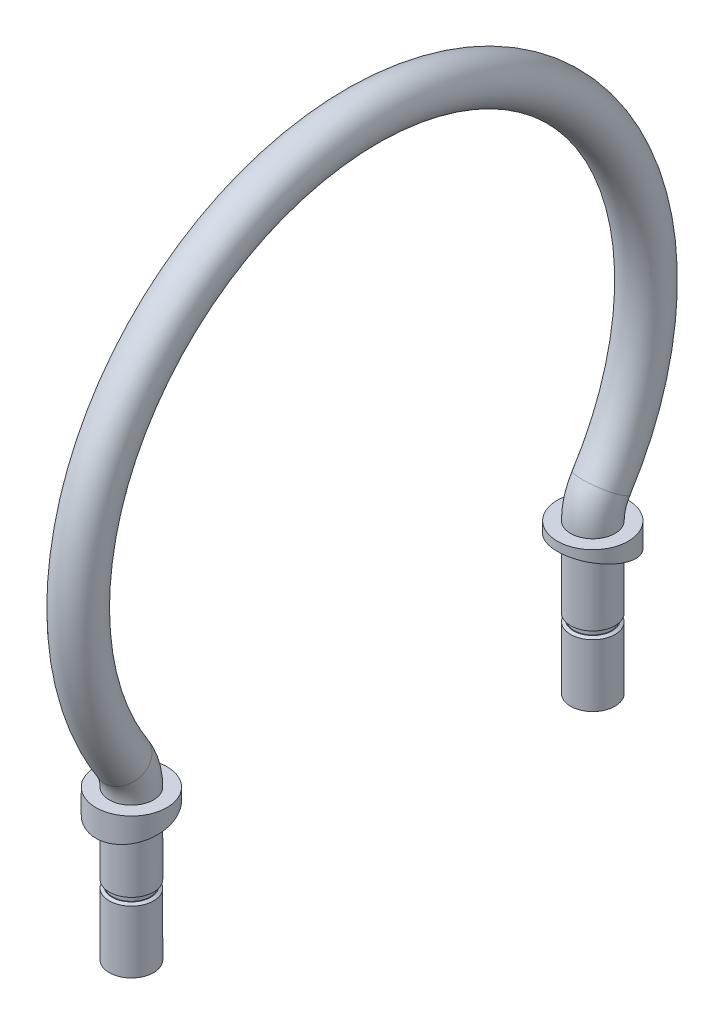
ISO-10303-21;
HEADER;
FILE_DESCRIPTION(('STEP AP214'),'2;1');
FILE_NAME('part.step','',(''),(''),'','','');
FILE_SCHEMA(('AUTOMOTIVE_DESIGN { 1 0 10303 214 1 1 1 1 }'));
ENDSEC;
DATA;
#1=APPLICATION_CONTEXT('core data for automotive mechanical design processes');
#2=APPLICATION_PROTOCOL_DEFINITION('international standard','automotive_design',2000,#1);
#3=PRODUCT_CONTEXT('',#1,'mechanical');
#4=PRODUCT('Part','Part','',(#3));
#5=PRODUCT_RELATED_PRODUCT_CATEGORY('part','',(#4));
#6=PRODUCT_DEFINITION_FORMATION('','',#4);
#7=PRODUCT_DEFINITION_CONTEXT('part definition',#1,'design');
#8=PRODUCT_DEFINITION('design','',#6,#7);
#9=PRODUCT_DEFINITION_SHAPE('','',#8);
#10=(LENGTH_UNIT() NAMED_UNIT(*) SI_UNIT(.MILLI.,.METRE.));
#11=(NAMED_UNIT(*) PLANE_ANGLE_UNIT() SI_UNIT($,.RADIAN.));
#12=(NAMED_UNIT(*) SI_UNIT($,.STERADIAN.) SOLID_ANGLE_UNIT());
#13=UNCERTAINTY_MEASURE_WITH_UNIT(LENGTH_MEASURE(1.E-05),#10,'distance_accuracy_value','');
#14=(GEOMETRIC_REPRESENTATION_CONTEXT(3) GLOBAL_UNCERTAINTY_ASSIGNED_CONTEXT((#13)) GLOBAL_UNIT_ASSIGNED_CONTEXT((#10,
#11,#12)) REPRESENTATION_CONTEXT('',''));
#15=CARTESIAN_POINT('',(0.,0.,0.));
#16=DIRECTION('',(0.,0.,1.));
#17=DIRECTION('',(1.,0.,0.));
#18=AXIS2_PLACEMENT_3D('',#15,#16,#17);
#19=CARTESIAN_POINT('',(0.,-14.2875,41.275));
#20=DIRECTION('',(0.,1.,0.));
#21=DIRECTION('',(0.,0.,1.));
#22=AXIS2_PLACEMENT_3D('',#19,#20,#21);
#23=PLANE('',#22);
#24=CARTESIAN_POINT('',(0.,-14.2875,41.275));
#25=DIRECTION('',(0.,1.,0.));
#26=DIRECTION('',(0.,0.,1.));
#27=AXIS2_PLACEMENT_3D('',#24,#25,#26);
#28=CIRCLE('',#27,3.96875);
#29=CARTESIAN_POINT('',(0.,-14.2875,45.24375));
#30=VERTEX_POINT('',#29);
#31=EDGE_CURVE('E76',#30,#30,#28,.T.);
#32=ORIENTED_EDGE('',*,*,#31,.F.);
#33=EDGE_LOOP('',(#32));
#34=FACE_BOUND('',#33,.T.);
#35=CARTESIAN_POINT('',(0.,-14.2875,41.275));
#36=DIRECTION('',(0.,1.,0.));
#37=DIRECTION('',(0.,0.,1.));
#38=AXIS2_PLACEMENT_3D('',#35,#36,#37);
#39=CIRCLE('',#38,3.33883);
#40=CARTESIAN_POINT('',(0.,-14.2875,44.61383));
#41=VERTEX_POINT('',#40);
#42=EDGE_CURVE('E66',#41,#41,#39,.F.);
#43=ORIENTED_EDGE('',*,*,#42,.F.);
#44=EDGE_LOOP('',(#43));
#45=FACE_BOUND('',#44,.T.);
#46=ADVANCED_FACE('F34',(#34,#45),#23,.F.);
#47=CARTESIAN_POINT('',(0.,-14.2875,-41.275));
#48=DIRECTION('',(0.,1.,0.));
#49=DIRECTION('',(0.,0.,1.));
#50=AXIS2_PLACEMENT_3D('',#47,#48,#49);
#51=PLANE('',#50);
#52=CARTESIAN_POINT('',(0.,-14.2875,-41.275));
#53=DIRECTION('',(0.,1.,0.));
#54=DIRECTION('',(0.,0.,1.));
#55=AXIS2_PLACEMENT_3D('',#52,#53,#54);
#56=CIRCLE('',#55,3.96875);
#57=CARTESIAN_POINT('',(0.,-14.2875,-37.30625));
#58=VERTEX_POINT('',#57);
#59=EDGE_CURVE('E77',#58,#58,#56,.T.);
#60=ORIENTED_EDGE('',*,*,#59,.F.);
#61=EDGE_LOOP('',(#60));
#62=FACE_BOUND('',#61,.T.);
#63=CARTESIAN_POINT('',(0.,-14.2875,-41.275));
#64=DIRECTION('',(0.,1.,0.));
#65=DIRECTION('',(0.,0.,1.));
#66=AXIS2_PLACEMENT_3D('',#63,#64,#65);
#67=CIRCLE('',#66,3.33883);
#68=CARTESIAN_POINT('',(0.,-14.2875,-37.93617));
#69=VERTEX_POINT('',#68);
#70=EDGE_CURVE('E69',#69,#69,#67,.F.);
#71=ORIENTED_EDGE('',*,*,#70,.F.);
#72=EDGE_LOOP('',(#71));
#73=FACE_BOUND('',#72,.T.);
#74=ADVANCED_FACE('F126',(#62,#73),#51,.F.);
#75=CARTESIAN_POINT('',(0.,0.,50.8));
#76=DIRECTION('',(-1.,0.,0.));
#77=DIRECTION('',(0.,0.,1.));
#78=AXIS2_PLACEMENT_3D('',#75,#76,#77);
#79=TOROIDAL_SURFACE('',#78,9.52500000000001,3.96875);
#80=CARTESIAN_POINT('',(0.,5.13695821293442,42.7789473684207));
#81=DIRECTION('',(0.,-0.842105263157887,-0.539313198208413));
#82=DIRECTION('',(0.,0.539313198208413,-0.842105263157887));
#83=AXIS2_PLACEMENT_3D('',#80,#81,#82);
#84=CIRCLE('',#83,3.96875);
#85=CARTESIAN_POINT('',(0.,7.27735746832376,39.4368421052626));
#86=VERTEX_POINT('',#85);
#87=EDGE_CURVE('E84',#86,#86,#84,.T.);
#88=CARTESIAN_POINT('',(0.,-6.66133814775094E-13,41.275));
#89=DIRECTION('',(0.,-1.,0.));
#90=DIRECTION('',(0.,0.,-1.));
#91=AXIS2_PLACEMENT_3D('',#88,#89,#90);
#92=CIRCLE('',#91,3.96875);
#93=CARTESIAN_POINT('',(0.,-9.43689570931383E-13,37.30625));
#94=VERTEX_POINT('',#93);
#95=EDGE_CURVE('E72',#94,#94,#92,.T.);
#96=CARTESIAN_POINT('',(0.,0.,50.8));
#97=DIRECTION('',(-1.,0.,0.));
#98=DIRECTION('',(0.,0.,1.));
#99=AXIS2_PLACEMENT_3D('',#96,#97,#98);
#100=CIRCLE('',#99,13.49375);
#101=EDGE_CURVE('',#86,#94,#100,.T.);
#102=ORIENTED_EDGE('',*,*,#87,.T.);
#103=ORIENTED_EDGE('',*,*,#95,.F.);
#104=ORIENTED_EDGE('',*,*,#101,.T.);
#105=ORIENTED_EDGE('',*,*,#101,.F.);
#106=EDGE_LOOP('',(#102,#104,#103,#105));
#107=FACE_BOUND('',#106,.T.);
#108=ADVANCED_FACE('F132',(#107),#79,.T.);
#109=CARTESIAN_POINT('',(0.,32.5340686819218,0.));
#110=DIRECTION('',(1.,0.,0.));
#111=DIRECTION('',(0.,0.,-1.));
#112=AXIS2_PLACEMENT_3D('',#109,#110,#111);
#113=TOROIDAL_SURFACE('',#112,50.8,3.96875);
#114=CARTESIAN_POINT('',(0.,5.13695821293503,-42.778947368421));
#115=DIRECTION('',(0.,0.842105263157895,-0.5393131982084));
#116=DIRECTION('',(0.,0.5393131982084,0.842105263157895));
#117=AXIS2_PLACEMENT_3D('',#114,#115,#116);
#118=CIRCLE('',#117,3.96875);
#119=CARTESIAN_POINT('',(0.,7.27735746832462,-39.4368421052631));
#120=VERTEX_POINT('',#119);
#121=EDGE_CURVE('E87',#120,#120,#118,.T.);
#122=ORIENTED_EDGE('',*,*,#121,.T.);
#123=EDGE_LOOP('',(#122));
#124=FACE_BOUND('',#123,.T.);
#125=ORIENTED_EDGE('',*,*,#87,.F.);
#126=EDGE_LOOP('',(#125));
#127=FACE_BOUND('',#126,.T.);
#128=ADVANCED_FACE('F170',(#124,#127),#113,.T.);
#129=CARTESIAN_POINT('',(0.,0.,-50.8));
#130=DIRECTION('',(1.,0.,0.));
#131=DIRECTION('',(0.,0.,-1.));
#132=AXIS2_PLACEMENT_3D('',#129,#130,#131);
#133=TOROIDAL_SURFACE('',#132,9.52500000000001,3.96875);
#134=CARTESIAN_POINT('',(0.,0.,-41.275));
#135=DIRECTION('',(0.,1.,0.));
#136=DIRECTION('',(0.,0.,1.));
#137=AXIS2_PLACEMENT_3D('',#134,#135,#136);
#138=CIRCLE('',#137,3.96875);
#139=CARTESIAN_POINT('',(0.,0.,-37.30625));
#140=VERTEX_POINT('',#139);
#141=EDGE_CURVE('E90',#140,#140,#138,.T.);
#142=CARTESIAN_POINT('',(0.,0.,-50.8));
#143=DIRECTION('',(1.,0.,0.));
#144=DIRECTION('',(0.,0.,-1.));
#145=AXIS2_PLACEMENT_3D('',#142,#143,#144);
#146=CIRCLE('',#145,13.49375);
#147=EDGE_CURVE('',#120,#140,#146,.T.);
#148=ORIENTED_EDGE('',*,*,#121,.F.);
#149=ORIENTED_EDGE('',*,*,#141,.T.);
#150=ORIENTED_EDGE('',*,*,#147,.T.);
#151=ORIENTED_EDGE('',*,*,#147,.F.);
#152=EDGE_LOOP('',(#148,#150,#149,#151));
#153=FACE_BOUND('',#152,.T.);
#154=ADVANCED_FACE('F163',(#153),#133,.T.);
#155=CARTESIAN_POINT('',(0.,0.,-41.275));
#156=DIRECTION('',(0.,1.,0.));
#157=DIRECTION('',(0.,0.,1.));
#158=AXIS2_PLACEMENT_3D('',#155,#156,#157);
#159=PLANE('',#158);
#160=CARTESIAN_POINT('',(0.,0.,-41.275));
#161=DIRECTION('',(0.,1.,0.));
#162=DIRECTION('',(0.,0.,1.));
#163=AXIS2_PLACEMENT_3D('',#160,#161,#162);
#164=CIRCLE('',#163,6.35);
#165=CARTESIAN_POINT('',(0.,0.,-34.925));
#166=VERTEX_POINT('',#165);
#167=EDGE_CURVE('E93',#166,#166,#164,.T.);
#168=ORIENTED_EDGE('',*,*,#167,.T.);
#169=EDGE_LOOP('',(#168));
#170=FACE_BOUND('',#169,.T.);
#171=ORIENTED_EDGE('',*,*,#141,.F.);
#172=EDGE_LOOP('',(#171));
#173=FACE_BOUND('',#172,.T.);
#174=ADVANCED_FACE('F160',(#170,#173),#159,.T.);
#175=CARTESIAN_POINT('',(0.,-4.7625,-41.275));
#176=DIRECTION('',(0.,1.,0.));
#177=DIRECTION('',(0.,0.,1.));
#178=AXIS2_PLACEMENT_3D('',#175,#176,#177);
#179=CYLINDRICAL_SURFACE('',#178,6.35);
#180=CARTESIAN_POINT('',(0.,-3.17499999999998,-41.275));
#181=DIRECTION('',(0.,0.970142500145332,-0.242535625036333));
#182=DIRECTION('',(0.,0.242535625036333,0.970142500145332));
#183=AXIS2_PLACEMENT_3D('',#180,#181,#182);
#184=ELLIPSE('',#183,6.54543018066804,6.35);
#185=CARTESIAN_POINT('',(0.,-1.58749999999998,-34.925));
#186=VERTEX_POINT('',#185);
#187=EDGE_CURVE('E81',#186,#186,#184,.F.);
#188=ORIENTED_EDGE('',*,*,#187,.F.);
#189=EDGE_LOOP('',(#188));
#190=FACE_BOUND('',#189,.T.);
#191=ORIENTED_EDGE('',*,*,#167,.F.);
#192=EDGE_LOOP('',(#191));
#193=FACE_BOUND('',#192,.T.);
#194=ADVANCED_FACE('F158',(#190,#193),#179,.T.);
#195=CARTESIAN_POINT('',(0.,-4.7625,41.275));
#196=DIRECTION('',(0.,1.,0.));
#197=DIRECTION('',(0.,0.,1.));
#198=AXIS2_PLACEMENT_3D('',#195,#196,#197);
#199=CYLINDRICAL_SURFACE('',#198,6.35);
#200=CARTESIAN_POINT('',(0.,-3.17499999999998,41.275));
#201=DIRECTION('',(0.,0.970142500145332,0.242535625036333));
#202=DIRECTION('',(0.,0.242535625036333,-0.970142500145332));
#203=AXIS2_PLACEMENT_3D('',#200,#201,#202);
#204=ELLIPSE('',#203,6.54543018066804,6.35);
#205=CARTESIAN_POINT('',(0.,-1.58749999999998,34.925));
#206=VERTEX_POINT('',#205);
#207=EDGE_CURVE('E99',#206,#206,#204,.F.);
#208=ORIENTED_EDGE('',*,*,#207,.F.);
#209=EDGE_LOOP('',(#208));
#210=FACE_BOUND('',#209,.T.);
#211=CARTESIAN_POINT('',(0.,0.,41.275));
#212=DIRECTION('',(0.,1.,0.));
#213=DIRECTION('',(0.,0.,1.));
#214=AXIS2_PLACEMENT_3D('',#211,#212,#213);
#215=CIRCLE('',#214,6.35);
#216=CARTESIAN_POINT('',(0.,0.,47.625));
#217=VERTEX_POINT('',#216);
#218=EDGE_CURVE('E96',#217,#217,#215,.T.);
#219=ORIENTED_EDGE('',*,*,#218,.F.);
#220=EDGE_LOOP('',(#219));
#221=FACE_BOUND('',#220,.T.);
#222=ADVANCED_FACE('F154',(#210,#221),#199,.T.);
#223=CARTESIAN_POINT('',(0.,0.,41.275));
#224=DIRECTION('',(0.,1.,0.));
#225=DIRECTION('',(0.,0.,1.));
#226=AXIS2_PLACEMENT_3D('',#223,#224,#225);
#227=PLANE('',#226);
#228=ORIENTED_EDGE('',*,*,#95,.T.);
#229=EDGE_LOOP('',(#228));
#230=FACE_BOUND('',#229,.T.);
#231=ORIENTED_EDGE('',*,*,#218,.T.);
#232=EDGE_LOOP('',(#231));
#233=FACE_BOUND('',#232,.T.);
#234=ADVANCED_FACE('F150',(#230,#233),#227,.T.);
#235=CARTESIAN_POINT('',(-6.35,-1.58750000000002,34.925));
#236=DIRECTION('',(0.,0.970142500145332,0.242535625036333));
#237=DIRECTION('',(0.,-0.242535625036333,0.970142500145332));
#238=AXIS2_PLACEMENT_3D('',#235,#236,#237);
#239=PLANE('',#238);
#240=CARTESIAN_POINT('',(0.,-3.17499999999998,41.275));
#241=DIRECTION('',(0.,0.970142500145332,0.242535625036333));
#242=DIRECTION('',(0.,0.242535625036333,-0.970142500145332));
#243=AXIS2_PLACEMENT_3D('',#240,#241,#242);
#244=ELLIPSE('',#243,4.09089386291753,3.96875);
#245=CARTESIAN_POINT('',(0.,-2.18281249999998,37.30625));
#246=VERTEX_POINT('',#245);
#247=EDGE_CURVE('E78',#246,#246,#244,.T.);
#248=ORIENTED_EDGE('',*,*,#247,.T.);
#249=EDGE_LOOP('',(#248));
#250=FACE_BOUND('',#249,.T.);
#251=ORIENTED_EDGE('',*,*,#207,.T.);
#252=EDGE_LOOP('',(#251));
#253=FACE_BOUND('',#252,.T.);
#254=ADVANCED_FACE('F146',(#250,#253),#239,.F.);
#255=CARTESIAN_POINT('',(-6.35,-1.58750000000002,-34.925));
#256=DIRECTION('',(0.,0.970142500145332,-0.242535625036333));
#257=DIRECTION('',(0.,0.242535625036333,0.970142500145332));
#258=AXIS2_PLACEMENT_3D('',#255,#256,#257);
#259=PLANE('',#258);
#260=CARTESIAN_POINT('',(0.,-3.17499999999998,-41.275));
#261=DIRECTION('',(0.,0.970142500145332,-0.242535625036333));
#262=DIRECTION('',(0.,0.242535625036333,0.970142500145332));
#263=AXIS2_PLACEMENT_3D('',#260,#261,#262);
#264=ELLIPSE('',#263,4.09089386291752,3.96875);
#265=CARTESIAN_POINT('',(0.,-2.18281249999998,-37.30625));
#266=VERTEX_POINT('',#265);
#267=EDGE_CURVE('E73',#266,#266,#264,.T.);
#268=ORIENTED_EDGE('',*,*,#267,.T.);
#269=EDGE_LOOP('',(#268));
#270=FACE_BOUND('',#269,.T.);
#271=ORIENTED_EDGE('',*,*,#187,.T.);
#272=EDGE_LOOP('',(#271));
#273=FACE_BOUND('',#272,.T.);
#274=ADVANCED_FACE('F142',(#270,#273),#259,.F.);
#275=CARTESIAN_POINT('',(0.,-14.2875,41.275));
#276=DIRECTION('',(0.,1.,0.));
#277=DIRECTION('',(0.,0.,1.));
#278=AXIS2_PLACEMENT_3D('',#275,#276,#277);
#279=CYLINDRICAL_SURFACE('',#278,3.96875);
#280=ORIENTED_EDGE('',*,*,#31,.T.);
#281=EDGE_LOOP('',(#280));
#282=FACE_BOUND('',#281,.T.);
#283=ORIENTED_EDGE('',*,*,#247,.F.);
#284=EDGE_LOOP('',(#283));
#285=FACE_BOUND('',#284,.T.);
#286=ADVANCED_FACE('F139',(#282,#285),#279,.T.);
#287=CARTESIAN_POINT('',(0.,-14.2875,-41.275));
#288=DIRECTION('',(0.,1.,0.));
#289=DIRECTION('',(0.,0.,1.));
#290=AXIS2_PLACEMENT_3D('',#287,#288,#289);
#291=CYLINDRICAL_SURFACE('',#290,3.96875);
#292=ORIENTED_EDGE('',*,*,#59,.T.);
#293=EDGE_LOOP('',(#292));
#294=FACE_BOUND('',#293,.T.);
#295=ORIENTED_EDGE('',*,*,#267,.F.);
#296=EDGE_LOOP('',(#295));
#297=FACE_BOUND('',#296,.T.);
#298=ADVANCED_FACE('F138',(#294,#297),#291,.T.);
#299=CARTESIAN_POINT('',(0.,-15.3458333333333,-41.275));
#300=DIRECTION('',(0.,1.,0.));
#301=DIRECTION('',(0.,0.,1.));
#302=AXIS2_PLACEMENT_3D('',#299,#300,#301);
#303=CYLINDRICAL_SURFACE('',#302,3.33883);
#304=CARTESIAN_POINT('',(0.,-15.3458333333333,-41.275));
#305=DIRECTION('',(0.,-1.,0.));
#306=DIRECTION('',(0.,0.,-1.));
#307=AXIS2_PLACEMENT_3D('',#304,#305,#306);
#308=CIRCLE('',#307,3.33883);
#309=CARTESIAN_POINT('',(0.,-15.3458333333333,-44.61383));
#310=VERTEX_POINT('',#309);
#311=EDGE_CURVE('E108',#310,#310,#308,.T.);
#312=ORIENTED_EDGE('',*,*,#311,.F.);
#313=EDGE_LOOP('',(#312));
#314=FACE_BOUND('',#313,.T.);
#315=ORIENTED_EDGE('',*,*,#70,.T.);
#316=EDGE_LOOP('',(#315));
#317=FACE_BOUND('',#316,.T.);
#318=ADVANCED_FACE('F121',(#314,#317),#303,.T.);
#319=CARTESIAN_POINT('',(0.,-15.3458333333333,41.275));
#320=DIRECTION('',(0.,1.,0.));
#321=DIRECTION('',(0.,0.,1.));
#322=AXIS2_PLACEMENT_3D('',#319,#320,#321);
#323=CYLINDRICAL_SURFACE('',#322,3.33883);
#324=CARTESIAN_POINT('',(0.,-15.3458333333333,41.275));
#325=DIRECTION('',(0.,-1.,0.));
#326=DIRECTION('',(0.,0.,-1.));
#327=AXIS2_PLACEMENT_3D('',#324,#325,#326);
#328=CIRCLE('',#327,3.33883);
#329=CARTESIAN_POINT('',(0.,-15.3458333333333,37.93617));
#330=VERTEX_POINT('',#329);
#331=EDGE_CURVE('E111',#330,#330,#328,.T.);
#332=ORIENTED_EDGE('',*,*,#331,.F.);
#333=EDGE_LOOP('',(#332));
#334=FACE_BOUND('',#333,.T.);
#335=ORIENTED_EDGE('',*,*,#42,.T.);
#336=EDGE_LOOP('',(#335));
#337=FACE_BOUND('',#336,.T.);
#338=ADVANCED_FACE('F117',(#334,#337),#323,.T.);
#339=CARTESIAN_POINT('',(0.,-15.3458333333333,-41.275));
#340=DIRECTION('',(0.,-1.,0.));
#341=DIRECTION('',(0.,0.,-1.));
#342=AXIS2_PLACEMENT_3D('',#339,#340,#341);
#343=PLANE('',#342);
#344=CARTESIAN_POINT('',(0.,-15.3458333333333,-41.275));
#345=DIRECTION('',(0.,-1.,0.));
#346=DIRECTION('',(0.,0.,-1.));
#347=AXIS2_PLACEMENT_3D('',#344,#345,#346);
#348=CIRCLE('',#347,3.46074999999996);
#349=CARTESIAN_POINT('',(0.,-15.3458333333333,-44.7357499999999));
#350=VERTEX_POINT('',#349);
#351=EDGE_CURVE('E10',#350,#350,#348,.F.);
#352=ORIENTED_EDGE('',*,*,#351,.T.);
#353=EDGE_LOOP('',(#352));
#354=FACE_BOUND('',#353,.T.);
#355=ORIENTED_EDGE('',*,*,#311,.T.);
#356=EDGE_LOOP('',(#355));
#357=FACE_BOUND('',#356,.T.);
#358=ADVANCED_FACE('F120',(#354,#357),#343,.F.);
#359=CARTESIAN_POINT('',(0.,-27.2330333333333,-41.275));
#360=DIRECTION('',(0.,1.,0.));
#361=DIRECTION('',(0.,0.,1.));
#362=AXIS2_PLACEMENT_3D('',#359,#360,#361);
#363=CYLINDRICAL_SURFACE('',#362,3.96875);
#364=CARTESIAN_POINT('',(0.,-15.6391272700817,-41.275));
#365=DIRECTION('',(0.,-1.,0.));
#366=DIRECTION('',(0.,0.,-1.));
#367=AXIS2_PLACEMENT_3D('',#364,#365,#366);
#368=CIRCLE('',#367,3.96875);
#369=CARTESIAN_POINT('',(0.,-15.6391272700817,-45.24375));
#370=VERTEX_POINT('',#369);
#371=EDGE_CURVE('E41',#370,#370,#368,.T.);
#372=ORIENTED_EDGE('',*,*,#371,.T.);
#373=EDGE_LOOP('',(#372));
#374=FACE_BOUND('',#373,.T.);
#375=CARTESIAN_POINT('',(0.,-26.7747615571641,-41.275));
#376=DIRECTION('',(0.,-1.,0.));
#377=DIRECTION('',(0.,0.,-1.));
#378=AXIS2_PLACEMENT_3D('',#375,#376,#377);
#379=CIRCLE('',#378,3.96875);
#380=CARTESIAN_POINT('',(0.,-26.7747615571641,-37.30625));
#381=VERTEX_POINT('',#380);
#382=EDGE_CURVE('E54',#381,#381,#379,.F.);
#383=ORIENTED_EDGE('',*,*,#382,.T.);
#384=EDGE_LOOP('',(#383));
#385=FACE_BOUND('',#384,.T.);
#386=ADVANCED_FACE('F216',(#374,#385),#363,.T.);
#387=CARTESIAN_POINT('',(0.,-27.2330333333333,-41.275));
#388=DIRECTION('',(0.,-1.,0.));
#389=DIRECTION('',(0.,0.,-1.));
#390=AXIS2_PLACEMENT_3D('',#387,#388,#389);
#391=PLANE('',#390);
#392=CARTESIAN_POINT('',(0.,-27.2330333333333,-41.275));
#393=DIRECTION('',(0.,-1.,0.));
#394=DIRECTION('',(0.,0.,-1.));
#395=AXIS2_PLACEMENT_3D('',#392,#393,#394);
#396=CIRCLE('',#395,3.17499999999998);
#397=CARTESIAN_POINT('',(0.,-27.2330333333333,-38.1));
#398=VERTEX_POINT('',#397);
#399=EDGE_CURVE('E57',#398,#398,#396,.T.);
#400=ORIENTED_EDGE('',*,*,#399,.T.);
#401=EDGE_LOOP('',(#400));
#402=FACE_BOUND('',#401,.T.);
#403=ADVANCED_FACE('F211',(#402),#391,.T.);
#404=CARTESIAN_POINT('',(0.,-15.3458333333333,41.275));
#405=DIRECTION('',(0.,-1.,0.));
#406=DIRECTION('',(0.,0.,-1.));
#407=AXIS2_PLACEMENT_3D('',#404,#405,#406);
#408=PLANE('',#407);
#409=CARTESIAN_POINT('',(0.,-15.3458333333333,41.275));
#410=DIRECTION('',(0.,-1.,0.));
#411=DIRECTION('',(0.,0.,-1.));
#412=AXIS2_PLACEMENT_3D('',#409,#410,#411);
#413=CIRCLE('',#412,3.46075000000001);
#414=CARTESIAN_POINT('',(0.,-15.3458333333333,37.81425));
#415=VERTEX_POINT('',#414);
#416=EDGE_CURVE('E45',#415,#415,#413,.F.);
#417=ORIENTED_EDGE('',*,*,#416,.T.);
#418=EDGE_LOOP('',(#417));
#419=FACE_BOUND('',#418,.T.);
#420=ORIENTED_EDGE('',*,*,#331,.T.);
#421=EDGE_LOOP('',(#420));
#422=FACE_BOUND('',#421,.T.);
#423=ADVANCED_FACE('F115',(#419,#422),#408,.F.);
#424=CARTESIAN_POINT('',(0.,-27.2330333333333,41.275));
#425=DIRECTION('',(0.,1.,0.));
#426=DIRECTION('',(0.,0.,1.));
#427=AXIS2_PLACEMENT_3D('',#424,#425,#426);
#428=CYLINDRICAL_SURFACE('',#427,3.96875);
#429=CARTESIAN_POINT('',(0.,-15.6391272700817,41.275));
#430=DIRECTION('',(0.,-1.,0.));
#431=DIRECTION('',(0.,0.,-1.));
#432=AXIS2_PLACEMENT_3D('',#429,#430,#431);
#433=CIRCLE('',#432,3.96875);
#434=CARTESIAN_POINT('',(0.,-15.6391272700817,37.30625));
#435=VERTEX_POINT('',#434);
#436=EDGE_CURVE('E49',#435,#435,#433,.T.);
#437=ORIENTED_EDGE('',*,*,#436,.T.);
#438=EDGE_LOOP('',(#437));
#439=FACE_BOUND('',#438,.T.);
#440=CARTESIAN_POINT('',(0.,-26.7747615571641,41.275));
#441=DIRECTION('',(0.,-1.,0.));
#442=DIRECTION('',(0.,0.,-1.));
#443=AXIS2_PLACEMENT_3D('',#440,#441,#442);
#444=CIRCLE('',#443,3.96875);
#445=CARTESIAN_POINT('',(0.,-26.7747615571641,45.24375));
#446=VERTEX_POINT('',#445);
#447=EDGE_CURVE('E60',#446,#446,#444,.F.);
#448=ORIENTED_EDGE('',*,*,#447,.T.);
#449=EDGE_LOOP('',(#448));
#450=FACE_BOUND('',#449,.T.);
#451=ADVANCED_FACE('F197',(#439,#450),#428,.T.);
#452=CARTESIAN_POINT('',(0.,-27.2330333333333,41.275));
#453=DIRECTION('',(0.,-1.,0.));
#454=DIRECTION('',(0.,0.,-1.));
#455=AXIS2_PLACEMENT_3D('',#452,#453,#454);
#456=PLANE('',#455);
#457=CARTESIAN_POINT('',(0.,-27.2330333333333,41.275));
#458=DIRECTION('',(0.,-1.,0.));
#459=DIRECTION('',(0.,0.,-1.));
#460=AXIS2_PLACEMENT_3D('',#457,#458,#459);
#461=CIRCLE('',#460,3.17499999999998);
#462=CARTESIAN_POINT('',(0.,-27.2330333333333,44.45));
#463=VERTEX_POINT('',#462);
#464=EDGE_CURVE('E63',#463,#463,#461,.T.);
#465=ORIENTED_EDGE('',*,*,#464,.T.);
#466=EDGE_LOOP('',(#465));
#467=FACE_BOUND('',#466,.T.);
#468=ADVANCED_FACE('F182',(#467),#456,.T.);
#469=CARTESIAN_POINT('',(0.,-27.2330333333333,41.275));
#470=DIRECTION('',(0.,1.,0.));
#471=DIRECTION('',(0.,0.,1.));
#472=AXIS2_PLACEMENT_3D('',#469,#470,#471);
#473=CONICAL_SURFACE('',#472,3.17499999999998,1.04719755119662);
#474=CARTESIAN_POINT('',(0.,-26.7747615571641,45.24375));
#475=CARTESIAN_POINT('',(0.,-26.7795352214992,45.2354817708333));
#476=CARTESIAN_POINT('',(0.,-26.7843088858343,45.2272135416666));
#477=CARTESIAN_POINT('',(0.,-26.7938562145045,45.2106770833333));
#478=CARTESIAN_POINT('',(0.,-26.7986298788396,45.2024088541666));
#479=CARTESIAN_POINT('',(0.,-26.8081772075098,45.1858723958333));
#480=CARTESIAN_POINT('',(0.,-26.8129508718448,45.1776041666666));
#481=CARTESIAN_POINT('',(0.,-26.822498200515,45.1610677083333));
#482=CARTESIAN_POINT('',(0.,-26.8272718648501,45.1527994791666));
#483=CARTESIAN_POINT('',(0.,-26.8368191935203,45.1362630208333));
#484=CARTESIAN_POINT('',(0.,-26.8415928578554,45.1279947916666));
#485=CARTESIAN_POINT('',(0.,-26.8511401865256,45.1114583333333));
#486=CARTESIAN_POINT('',(0.,-26.8559138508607,45.1031901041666));
#487=CARTESIAN_POINT('',(0.,-26.8654611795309,45.0866536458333));
#488=CARTESIAN_POINT('',(0.,-26.870234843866,45.0783854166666));
#489=CARTESIAN_POINT('',(0.,-26.8797821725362,45.0618489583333));
#490=CARTESIAN_POINT('',(0.,-26.8845558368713,45.0535807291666));
#491=CARTESIAN_POINT('',(0.,-26.8941031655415,45.0370442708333));
#492=CARTESIAN_POINT('',(0.,-26.8988768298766,45.0287760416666));
#493=CARTESIAN_POINT('',(0.,-26.9084241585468,45.0122395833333));
#494=CARTESIAN_POINT('',(0.,-26.9131978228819,45.0039713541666));
#495=CARTESIAN_POINT('',(0.,-26.9227451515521,44.9874348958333));
#496=CARTESIAN_POINT('',(0.,-26.9275188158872,44.9791666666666));
#497=CARTESIAN_POINT('',(0.,-26.9370661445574,44.9626302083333));
#498=CARTESIAN_POINT('',(0.,-26.9418398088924,44.9543619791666));
#499=CARTESIAN_POINT('',(0.,-26.9513871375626,44.9378255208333));
#500=CARTESIAN_POINT('',(0.,-26.9561608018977,44.9295572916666));
#501=CARTESIAN_POINT('',(0.,-26.9657081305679,44.9130208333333));
#502=CARTESIAN_POINT('',(0.,-26.970481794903,44.9047526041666));
#503=CARTESIAN_POINT('',(0.,-26.9800291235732,44.8882161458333));
#504=CARTESIAN_POINT('',(0.,-26.9848027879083,44.8799479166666));
#505=CARTESIAN_POINT('',(0.,-26.9943501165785,44.8634114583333));
#506=CARTESIAN_POINT('',(0.,-26.9991237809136,44.8551432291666));
#507=CARTESIAN_POINT('',(0.,-27.0086711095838,44.8386067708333));
#508=CARTESIAN_POINT('',(0.,-27.0134447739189,44.8303385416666));
#509=CARTESIAN_POINT('',(0.,-27.0229921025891,44.8138020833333));
#510=CARTESIAN_POINT('',(0.,-27.0277657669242,44.8055338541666));
#511=CARTESIAN_POINT('',(0.,-27.0373130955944,44.7889973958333));
#512=CARTESIAN_POINT('',(0.,-27.0420867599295,44.7807291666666));
#513=CARTESIAN_POINT('',(0.,-27.0516340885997,44.7641927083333));
#514=CARTESIAN_POINT('',(0.,-27.0564077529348,44.7559244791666));
#515=CARTESIAN_POINT('',(0.,-27.065955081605,44.7393880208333));
#516=CARTESIAN_POINT('',(0.,-27.07072874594,44.7311197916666));
#517=CARTESIAN_POINT('',(0.,-27.0802760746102,44.7145833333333));
#518=CARTESIAN_POINT('',(0.,-27.0850497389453,44.7063151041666));
#519=CARTESIAN_POINT('',(0.,-27.0945970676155,44.6897786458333));
#520=CARTESIAN_POINT('',(0.,-27.0993707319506,44.6815104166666));
#521=CARTESIAN_POINT('',(0.,-27.1089180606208,44.6649739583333));
#522=CARTESIAN_POINT('',(0.,-27.1136917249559,44.6567057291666));
#523=CARTESIAN_POINT('',(0.,-27.1232390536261,44.6401692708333));
#524=CARTESIAN_POINT('',(0.,-27.1280127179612,44.6319010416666));
#525=CARTESIAN_POINT('',(0.,-27.1375600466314,44.6153645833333));
#526=CARTESIAN_POINT('',(0.,-27.1423337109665,44.6070963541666));
#527=CARTESIAN_POINT('',(0.,-27.1518810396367,44.5905598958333));
#528=CARTESIAN_POINT('',(0.,-27.1566547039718,44.5822916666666));
#529=CARTESIAN_POINT('',(0.,-27.166202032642,44.5657552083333));
#530=CARTESIAN_POINT('',(0.,-27.1709756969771,44.5574869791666));
#531=CARTESIAN_POINT('',(0.,-27.1805230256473,44.5409505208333));
#532=CARTESIAN_POINT('',(0.,-27.1852966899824,44.5326822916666));
#533=CARTESIAN_POINT('',(0.,-27.1948440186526,44.5161458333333));
#534=CARTESIAN_POINT('',(0.,-27.1996176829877,44.5078776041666));
#535=CARTESIAN_POINT('',(0.,-27.2091650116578,44.4913411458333));
#536=CARTESIAN_POINT('',(0.,-27.2139386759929,44.4830729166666));
#537=CARTESIAN_POINT('',(0.,-27.2234860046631,44.4665364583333));
#538=CARTESIAN_POINT('',(0.,-27.2282596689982,44.4582682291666));
#539=CARTESIAN_POINT('',(0.,-27.2330333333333,44.45));
#540=B_SPLINE_CURVE_WITH_KNOTS('',3,(#474,#475,#476,#477,#478,#479,#480,#481,#482,#483,#484,
#485,#486,#487,#488,#489,#490,#491,#492,#493,#494,#495,#496,#497,#498,#499,#500,#501,#502,#503,
#504,#505,#506,#507,#508,#509,#510,#511,#512,#513,#514,#515,#516,#517,#518,#519,#520,#521,#522,
#523,#524,#525,#526,#527,#528,#529,#530,#531,#532,#533,#534,#535,#536,#537,#538,#539),
.UNSPECIFIED.,.F.,.F.,(4,2,2,2,2,2,2,2,2,2,2,2,2,2,2,2,2,2,2,2,2,2,2,2,2,2,2,2,2,2,2,2,4),(0.,
0.028641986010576,0.0572839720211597,0.0859259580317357,0.114567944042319,0.143209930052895,
0.171851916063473,0.200493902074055,0.229135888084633,0.257777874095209,0.286419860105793,
0.315061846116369,0.343703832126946,0.372345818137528,0.400987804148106,0.429629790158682,
0.458271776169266,0.486913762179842,0.51555574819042,0.544197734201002,0.572839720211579,
0.601481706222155,0.630123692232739,0.658765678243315,0.687407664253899,0.716049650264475,
0.744691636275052,0.773333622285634,0.801975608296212,0.830617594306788,0.859259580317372,
0.887901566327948,0.916543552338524),.UNSPECIFIED.);
#541=EDGE_CURVE('BSEAM178',#446,#463,#540,.T.);
#542=ORIENTED_EDGE('',*,*,#447,.F.);
#543=ORIENTED_EDGE('',*,*,#464,.F.);
#544=ORIENTED_EDGE('',*,*,#541,.T.);
#545=ORIENTED_EDGE('',*,*,#541,.F.);
#546=EDGE_LOOP('',(#542,#544,#543,#545));
#547=FACE_BOUND('',#546,.T.);
#548=ADVANCED_FACE('F178',(#547),#473,.T.);
#549=CARTESIAN_POINT('',(0.,-27.2330333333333,-41.275));
#550=DIRECTION('',(0.,1.,0.));
#551=DIRECTION('',(0.,0.,1.));
#552=AXIS2_PLACEMENT_3D('',#549,#550,#551);
#553=CONICAL_SURFACE('',#552,3.17499999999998,1.04719755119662);
#554=CARTESIAN_POINT('',(0.,-26.7747615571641,-37.30625));
#555=CARTESIAN_POINT('',(0.,-26.7795352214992,-37.3145182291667));
#556=CARTESIAN_POINT('',(0.,-26.7843088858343,-37.3227864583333));
#557=CARTESIAN_POINT('',(0.,-26.7938562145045,-37.3393229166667));
#558=CARTESIAN_POINT('',(0.,-26.7986298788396,-37.3475911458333));
#559=CARTESIAN_POINT('',(0.,-26.8081772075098,-37.3641276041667));
#560=CARTESIAN_POINT('',(0.,-26.8129508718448,-37.3723958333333));
#561=CARTESIAN_POINT('',(0.,-26.822498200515,-37.3889322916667));
#562=CARTESIAN_POINT('',(0.,-26.8272718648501,-37.3972005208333));
#563=CARTESIAN_POINT('',(0.,-26.8368191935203,-37.4137369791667));
#564=CARTESIAN_POINT('',(0.,-26.8415928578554,-37.4220052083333));
#565=CARTESIAN_POINT('',(0.,-26.8511401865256,-37.4385416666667));
#566=CARTESIAN_POINT('',(0.,-26.8559138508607,-37.4468098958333));
#567=CARTESIAN_POINT('',(0.,-26.8654611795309,-37.4633463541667));
#568=CARTESIAN_POINT('',(0.,-26.870234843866,-37.4716145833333));
#569=CARTESIAN_POINT('',(0.,-26.8797821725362,-37.4881510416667));
#570=CARTESIAN_POINT('',(0.,-26.8845558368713,-37.4964192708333));
#571=CARTESIAN_POINT('',(0.,-26.8941031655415,-37.5129557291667));
#572=CARTESIAN_POINT('',(0.,-26.8988768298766,-37.5212239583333));
#573=CARTESIAN_POINT('',(0.,-26.9084241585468,-37.5377604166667));
#574=CARTESIAN_POINT('',(0.,-26.9131978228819,-37.5460286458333));
#575=CARTESIAN_POINT('',(0.,-26.9227451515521,-37.5625651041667));
#576=CARTESIAN_POINT('',(0.,-26.9275188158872,-37.5708333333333));
#577=CARTESIAN_POINT('',(0.,-26.9370661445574,-37.5873697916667));
#578=CARTESIAN_POINT('',(0.,-26.9418398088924,-37.5956380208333));
#579=CARTESIAN_POINT('',(0.,-26.9513871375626,-37.6121744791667));
#580=CARTESIAN_POINT('',(0.,-26.9561608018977,-37.6204427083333));
#581=CARTESIAN_POINT('',(0.,-26.9657081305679,-37.6369791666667));
#582=CARTESIAN_POINT('',(0.,-26.970481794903,-37.6452473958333));
#583=CARTESIAN_POINT('',(0.,-26.9800291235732,-37.6617838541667));
#584=CARTESIAN_POINT('',(0.,-26.9848027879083,-37.6700520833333));
#585=CARTESIAN_POINT('',(0.,-26.9943501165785,-37.6865885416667));
#586=CARTESIAN_POINT('',(0.,-26.9991237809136,-37.6948567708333));
#587=CARTESIAN_POINT('',(0.,-27.0086711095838,-37.7113932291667));
#588=CARTESIAN_POINT('',(0.,-27.0134447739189,-37.7196614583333));
#589=CARTESIAN_POINT('',(0.,-27.0229921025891,-37.7361979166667));
#590=CARTESIAN_POINT('',(0.,-27.0277657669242,-37.7444661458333));
#591=CARTESIAN_POINT('',(0.,-27.0373130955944,-37.7610026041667));
#592=CARTESIAN_POINT('',(0.,-27.0420867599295,-37.7692708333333));
#593=CARTESIAN_POINT('',(0.,-27.0516340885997,-37.7858072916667));
#594=CARTESIAN_POINT('',(0.,-27.0564077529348,-37.7940755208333));
#595=CARTESIAN_POINT('',(0.,-27.065955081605,-37.8106119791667));
#596=CARTESIAN_POINT('',(0.,-27.07072874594,-37.8188802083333));
#597=CARTESIAN_POINT('',(0.,-27.0802760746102,-37.8354166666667));
#598=CARTESIAN_POINT('',(0.,-27.0850497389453,-37.8436848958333));
#599=CARTESIAN_POINT('',(0.,-27.0945970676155,-37.8602213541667));
#600=CARTESIAN_POINT('',(0.,-27.0993707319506,-37.8684895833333));
#601=CARTESIAN_POINT('',(0.,-27.1089180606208,-37.8850260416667));
#602=CARTESIAN_POINT('',(0.,-27.1136917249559,-37.8932942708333));
#603=CARTESIAN_POINT('',(0.,-27.1232390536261,-37.9098307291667));
#604=CARTESIAN_POINT('',(0.,-27.1280127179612,-37.9180989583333));
#605=CARTESIAN_POINT('',(0.,-27.1375600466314,-37.9346354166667));
#606=CARTESIAN_POINT('',(0.,-27.1423337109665,-37.9429036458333));
#607=CARTESIAN_POINT('',(0.,-27.1518810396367,-37.9594401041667));
#608=CARTESIAN_POINT('',(0.,-27.1566547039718,-37.9677083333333));
#609=CARTESIAN_POINT('',(0.,-27.166202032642,-37.9842447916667));
#610=CARTESIAN_POINT('',(0.,-27.1709756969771,-37.9925130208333));
#611=CARTESIAN_POINT('',(0.,-27.1805230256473,-38.0090494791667));
#612=CARTESIAN_POINT('',(0.,-27.1852966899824,-38.0173177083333));
#613=CARTESIAN_POINT('',(0.,-27.1948440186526,-38.0338541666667));
#614=CARTESIAN_POINT('',(0.,-27.1996176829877,-38.0421223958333));
#615=CARTESIAN_POINT('',(0.,-27.2091650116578,-38.0586588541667));
#616=CARTESIAN_POINT('',(0.,-27.2139386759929,-38.0669270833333));
#617=CARTESIAN_POINT('',(0.,-27.2234860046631,-38.0834635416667));
#618=CARTESIAN_POINT('',(0.,-27.2282596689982,-38.0917317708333));
#619=CARTESIAN_POINT('',(0.,-27.2330333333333,-38.1));
#620=B_SPLINE_CURVE_WITH_KNOTS('',3,(#554,#555,#556,#557,#558,#559,#560,#561,#562,#563,#564,
#565,#566,#567,#568,#569,#570,#571,#572,#573,#574,#575,#576,#577,#578,#579,#580,#581,#582,#583,
#584,#585,#586,#587,#588,#589,#590,#591,#592,#593,#594,#595,#596,#597,#598,#599,#600,#601,#602,
#603,#604,#605,#606,#607,#608,#609,#610,#611,#612,#613,#614,#615,#616,#617,#618,#619),
.UNSPECIFIED.,.F.,.F.,(4,2,2,2,2,2,2,2,2,2,2,2,2,2,2,2,2,2,2,2,2,2,2,2,2,2,2,2,2,2,2,2,4),(0.,
0.028641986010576,0.0572839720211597,0.0859259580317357,0.114567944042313,0.143209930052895,
0.171851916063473,0.200493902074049,0.229135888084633,0.257777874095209,0.286419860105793,
0.315061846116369,0.343703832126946,0.372345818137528,0.400987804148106,0.429629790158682,
0.458271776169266,0.486913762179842,0.51555574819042,0.544197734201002,0.572839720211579,
0.601481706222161,0.630123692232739,0.658765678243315,0.687407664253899,0.716049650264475,
0.744691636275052,0.773333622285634,0.801975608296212,0.830617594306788,0.859259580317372,
0.887901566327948,0.916543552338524),.UNSPECIFIED.);
#621=EDGE_CURVE('BSEAM181',#381,#398,#620,.T.);
#622=ORIENTED_EDGE('',*,*,#382,.F.);
#623=ORIENTED_EDGE('',*,*,#399,.F.);
#624=ORIENTED_EDGE('',*,*,#621,.T.);
#625=ORIENTED_EDGE('',*,*,#621,.F.);
#626=EDGE_LOOP('',(#622,#624,#623,#625));
#627=FACE_BOUND('',#626,.T.);
#628=ADVANCED_FACE('F181',(#627),#553,.T.);
#629=CARTESIAN_POINT('',(0.,-15.6391272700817,41.275));
#630=DIRECTION('',(0.,-1.,0.));
#631=DIRECTION('',(0.,0.,-1.));
#632=AXIS2_PLACEMENT_3D('',#629,#630,#631);
#633=CONICAL_SURFACE('',#632,3.96875,1.04719755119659);
#634=ORIENTED_EDGE('',*,*,#416,.F.);
#635=EDGE_LOOP('',(#634));
#636=FACE_BOUND('',#635,.T.);
#637=ORIENTED_EDGE('',*,*,#436,.F.);
#638=EDGE_LOOP('',(#637));
#639=FACE_BOUND('',#638,.T.);
#640=ADVANCED_FACE('F185',(#636,#639),#633,.T.);
#641=CARTESIAN_POINT('',(0.,-15.6391272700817,-41.275));
#642=DIRECTION('',(0.,-1.,0.));
#643=DIRECTION('',(0.,0.,-1.));
#644=AXIS2_PLACEMENT_3D('',#641,#642,#643);
#645=CONICAL_SURFACE('',#644,3.96875,1.0471975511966);
#646=ORIENTED_EDGE('',*,*,#351,.F.);
#647=EDGE_LOOP('',(#646));
#648=FACE_BOUND('',#647,.T.);
#649=ORIENTED_EDGE('',*,*,#371,.F.);
#650=EDGE_LOOP('',(#649));
#651=FACE_BOUND('',#650,.T.);
#652=ADVANCED_FACE('F36',(#648,#651),#645,.T.);
#653=CLOSED_SHELL('',(#46,#74,#108,#128,#154,#174,#194,#222,#234,#254,#274,#286,#298,#318,#338,
#358,#386,#403,#423,#451,#468,#548,#628,#640,#652));
#654=MANIFOLD_SOLID_BREP('B2',#653);
#655=ADVANCED_BREP_SHAPE_REPRESENTATION('',(#18,#654),#14);
#656=SHAPE_DEFINITION_REPRESENTATION(#9,#655);
ENDSEC;
END-ISO-10303-21;
